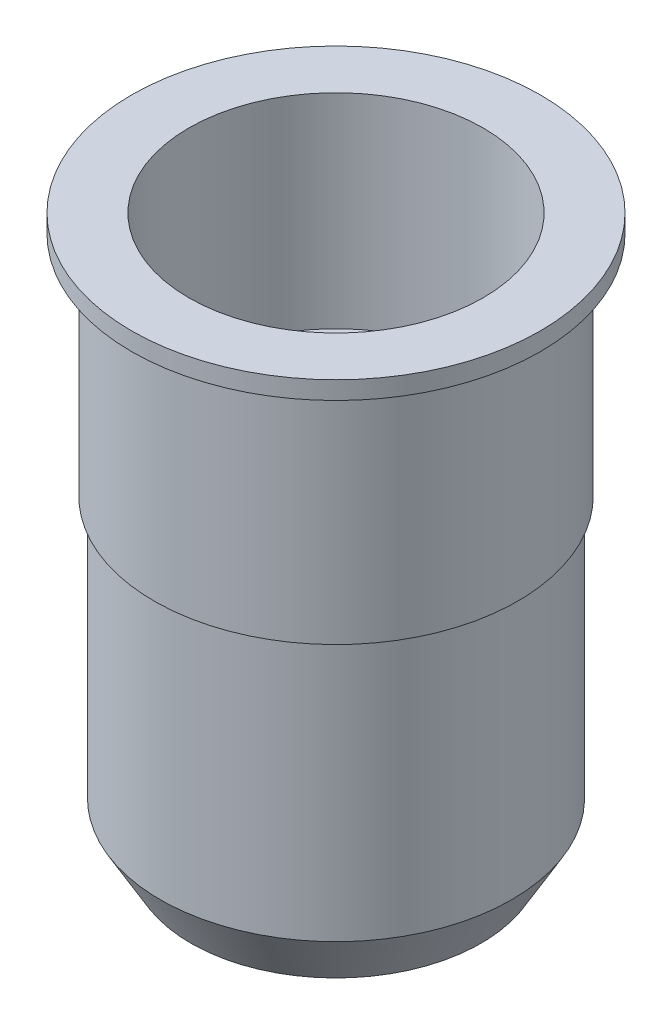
ISO-10303-21;
HEADER;
FILE_DESCRIPTION(('STEP AP214'),'2;1');
FILE_NAME('part.step','',(''),(''),'','','');
FILE_SCHEMA(('AUTOMOTIVE_DESIGN { 1 0 10303 214 1 1 1 1 }'));
ENDSEC;
DATA;
#1=APPLICATION_CONTEXT('core data for automotive mechanical design processes');
#2=APPLICATION_PROTOCOL_DEFINITION('international standard','automotive_design',2000,#1);
#3=PRODUCT_CONTEXT('',#1,'mechanical');
#4=PRODUCT('Part','Part','',(#3));
#5=PRODUCT_RELATED_PRODUCT_CATEGORY('part','',(#4));
#6=PRODUCT_DEFINITION_FORMATION('','',#4);
#7=PRODUCT_DEFINITION_CONTEXT('part definition',#1,'design');
#8=PRODUCT_DEFINITION('design','',#6,#7);
#9=PRODUCT_DEFINITION_SHAPE('','',#8);
#10=(LENGTH_UNIT() NAMED_UNIT(*) SI_UNIT(.MILLI.,.METRE.));
#11=(NAMED_UNIT(*) PLANE_ANGLE_UNIT() SI_UNIT($,.RADIAN.));
#12=(NAMED_UNIT(*) SI_UNIT($,.STERADIAN.) SOLID_ANGLE_UNIT());
#13=UNCERTAINTY_MEASURE_WITH_UNIT(LENGTH_MEASURE(1.E-05),#10,'distance_accuracy_value','');
#14=(GEOMETRIC_REPRESENTATION_CONTEXT(3) GLOBAL_UNCERTAINTY_ASSIGNED_CONTEXT((#13)) GLOBAL_UNIT_ASSIGNED_CONTEXT((#10,
#11,#12)) REPRESENTATION_CONTEXT('',''));
#15=CARTESIAN_POINT('',(0.,0.,0.));
#16=DIRECTION('',(0.,0.,1.));
#17=DIRECTION('',(1.,0.,0.));
#18=AXIS2_PLACEMENT_3D('',#15,#16,#17);
#19=CARTESIAN_POINT('',(4.3,-13.7,0.));
#20=DIRECTION('',(0.,1.,0.));
#21=DIRECTION('',(-1.,0.,0.));
#22=AXIS2_PLACEMENT_3D('',#19,#20,#21);
#23=PLANE('',#22);
#24=CARTESIAN_POINT('',(0.,-13.7,0.));
#25=DIRECTION('',(0.,1.,0.));
#26=DIRECTION('',(-1.,0.,0.));
#27=AXIS2_PLACEMENT_3D('',#24,#25,#26);
#28=CIRCLE('',#27,3.54999999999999);
#29=CARTESIAN_POINT('',(-3.54999999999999,-13.7,0.));
#30=VERTEX_POINT('',#29);
#31=EDGE_CURVE('E36',#30,#30,#28,.F.);
#32=ORIENTED_EDGE('',*,*,#31,.T.);
#33=EDGE_LOOP('',(#32));
#34=FACE_BOUND('',#33,.T.);
#35=CARTESIAN_POINT('',(0.,-13.7,0.));
#36=DIRECTION('',(0.,1.,0.));
#37=DIRECTION('',(-1.,0.,0.));
#38=AXIS2_PLACEMENT_3D('',#35,#36,#37);
#39=CIRCLE('',#38,2.5);
#40=CARTESIAN_POINT('',(-2.5,-13.7,0.));
#41=VERTEX_POINT('',#40);
#42=EDGE_CURVE('E45',#41,#41,#39,.T.);
#43=ORIENTED_EDGE('',*,*,#42,.T.);
#44=EDGE_LOOP('',(#43));
#45=FACE_BOUND('',#44,.T.);
#46=ADVANCED_FACE('F26',(#34,#45),#23,.F.);
#47=CARTESIAN_POINT('',(0.,6.30148961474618,0.));
#48=DIRECTION('',(0.,1.,0.));
#49=DIRECTION('',(-1.,0.,0.));
#50=AXIS2_PLACEMENT_3D('',#47,#48,#49);
#51=CYLINDRICAL_SURFACE('',#50,2.5);
#52=ORIENTED_EDGE('',*,*,#42,.F.);
#53=EDGE_LOOP('',(#52));
#54=FACE_BOUND('',#53,.T.);
#55=CARTESIAN_POINT('',(0.,-5.,0.));
#56=DIRECTION('',(0.,1.,0.));
#57=DIRECTION('',(-1.,0.,0.));
#58=AXIS2_PLACEMENT_3D('',#55,#56,#57);
#59=CIRCLE('',#58,2.5);
#60=CARTESIAN_POINT('',(-2.5,-5.,0.));
#61=VERTEX_POINT('',#60);
#62=EDGE_CURVE('E48',#61,#61,#59,.T.);
#63=ORIENTED_EDGE('',*,*,#62,.T.);
#64=EDGE_LOOP('',(#63));
#65=FACE_BOUND('',#64,.T.);
#66=ADVANCED_FACE('F88',(#54,#65),#51,.F.);
#67=CARTESIAN_POINT('',(2.5,-5.,0.));
#68=DIRECTION('',(0.,-1.,0.));
#69=DIRECTION('',(1.,0.,0.));
#70=AXIS2_PLACEMENT_3D('',#67,#68,#69);
#71=PLANE('',#70);
#72=ORIENTED_EDGE('',*,*,#62,.F.);
#73=EDGE_LOOP('',(#72));
#74=FACE_BOUND('',#73,.T.);
#75=CARTESIAN_POINT('',(0.,-5.,0.));
#76=DIRECTION('',(0.,1.,0.));
#77=DIRECTION('',(-1.,0.,0.));
#78=AXIS2_PLACEMENT_3D('',#75,#76,#77);
#79=CIRCLE('',#78,3.6);
#80=CARTESIAN_POINT('',(-3.6,-5.,0.));
#81=VERTEX_POINT('',#80);
#82=EDGE_CURVE('E51',#81,#81,#79,.T.);
#83=ORIENTED_EDGE('',*,*,#82,.T.);
#84=EDGE_LOOP('',(#83));
#85=FACE_BOUND('',#84,.T.);
#86=ADVANCED_FACE('F93',(#74,#85),#71,.F.);
#87=CARTESIAN_POINT('',(0.,6.30148961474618,0.));
#88=DIRECTION('',(0.,1.,0.));
#89=DIRECTION('',(-1.,0.,0.));
#90=AXIS2_PLACEMENT_3D('',#87,#88,#89);
#91=CYLINDRICAL_SURFACE('',#90,3.6);
#92=ORIENTED_EDGE('',*,*,#82,.F.);
#93=EDGE_LOOP('',(#92));
#94=FACE_BOUND('',#93,.T.);
#95=CARTESIAN_POINT('',(0.,0.,0.));
#96=DIRECTION('',(0.,1.,0.));
#97=DIRECTION('',(-1.,0.,0.));
#98=AXIS2_PLACEMENT_3D('',#95,#96,#97);
#99=CIRCLE('',#98,3.6);
#100=CARTESIAN_POINT('',(-3.6,0.,0.));
#101=VERTEX_POINT('',#100);
#102=EDGE_CURVE('E54',#101,#101,#99,.T.);
#103=ORIENTED_EDGE('',*,*,#102,.T.);
#104=EDGE_LOOP('',(#103));
#105=FACE_BOUND('',#104,.T.);
#106=ADVANCED_FACE('F103',(#94,#105),#91,.F.);
#107=CARTESIAN_POINT('',(3.6,0.,0.));
#108=DIRECTION('',(0.,-1.,0.));
#109=DIRECTION('',(1.,0.,0.));
#110=AXIS2_PLACEMENT_3D('',#107,#108,#109);
#111=PLANE('',#110);
#112=ORIENTED_EDGE('',*,*,#102,.F.);
#113=EDGE_LOOP('',(#112));
#114=FACE_BOUND('',#113,.T.);
#115=CARTESIAN_POINT('',(0.,0.,0.));
#116=DIRECTION('',(0.,1.,0.));
#117=DIRECTION('',(-1.,0.,0.));
#118=AXIS2_PLACEMENT_3D('',#115,#116,#117);
#119=CIRCLE('',#118,5.);
#120=CARTESIAN_POINT('',(-5.,0.,0.));
#121=VERTEX_POINT('',#120);
#122=EDGE_CURVE('E57',#121,#121,#119,.T.);
#123=ORIENTED_EDGE('',*,*,#122,.T.);
#124=EDGE_LOOP('',(#123));
#125=FACE_BOUND('',#124,.T.);
#126=ADVANCED_FACE('F109',(#114,#125),#111,.F.);
#127=CARTESIAN_POINT('',(0.,6.30148961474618,0.));
#128=DIRECTION('',(0.,1.,0.));
#129=DIRECTION('',(-1.,0.,0.));
#130=AXIS2_PLACEMENT_3D('',#127,#128,#129);
#131=CYLINDRICAL_SURFACE('',#130,5.);
#132=CARTESIAN_POINT('',(0.,-0.440192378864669,0.));
#133=DIRECTION('',(0.,1.,0.));
#134=DIRECTION('',(-1.,0.,0.));
#135=AXIS2_PLACEMENT_3D('',#132,#133,#134);
#136=CIRCLE('',#135,5.);
#137=CARTESIAN_POINT('',(-5.,-0.44019237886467,0.));
#138=VERTEX_POINT('',#137);
#139=EDGE_CURVE('E32',#138,#138,#136,.T.);
#140=ORIENTED_EDGE('',*,*,#139,.T.);
#141=EDGE_LOOP('',(#140));
#142=FACE_BOUND('',#141,.T.);
#143=ORIENTED_EDGE('',*,*,#122,.F.);
#144=EDGE_LOOP('',(#143));
#145=FACE_BOUND('',#144,.T.);
#146=ADVANCED_FACE('F115',(#142,#145),#131,.T.);
#147=CARTESIAN_POINT('',(4.45,-0.7,0.));
#148=DIRECTION('',(0.,1.,0.));
#149=DIRECTION('',(-1.,0.,0.));
#150=AXIS2_PLACEMENT_3D('',#147,#148,#149);
#151=PLANE('',#150);
#152=CARTESIAN_POINT('',(0.,-0.700000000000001,0.));
#153=DIRECTION('',(0.,1.,0.));
#154=DIRECTION('',(-1.,0.,0.));
#155=AXIS2_PLACEMENT_3D('',#152,#153,#154);
#156=CIRCLE('',#155,4.55);
#157=CARTESIAN_POINT('',(-4.55,-0.700000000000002,0.));
#158=VERTEX_POINT('',#157);
#159=EDGE_CURVE('E10',#158,#158,#156,.F.);
#160=ORIENTED_EDGE('',*,*,#159,.T.);
#161=EDGE_LOOP('',(#160));
#162=FACE_BOUND('',#161,.T.);
#163=CARTESIAN_POINT('',(0.,-0.700000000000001,0.));
#164=DIRECTION('',(0.,1.,0.));
#165=DIRECTION('',(-1.,0.,0.));
#166=AXIS2_PLACEMENT_3D('',#163,#164,#165);
#167=CIRCLE('',#166,4.45);
#168=CARTESIAN_POINT('',(-4.45,-0.700000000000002,0.));
#169=VERTEX_POINT('',#168);
#170=EDGE_CURVE('E60',#169,#169,#167,.T.);
#171=ORIENTED_EDGE('',*,*,#170,.T.);
#172=EDGE_LOOP('',(#171));
#173=FACE_BOUND('',#172,.T.);
#174=ADVANCED_FACE('F120',(#162,#173),#151,.F.);
#175=CARTESIAN_POINT('',(0.,6.30148961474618,0.));
#176=DIRECTION('',(0.,1.,0.));
#177=DIRECTION('',(-1.,0.,0.));
#178=AXIS2_PLACEMENT_3D('',#175,#176,#177);
#179=CYLINDRICAL_SURFACE('',#178,4.45);
#180=ORIENTED_EDGE('',*,*,#170,.F.);
#181=EDGE_LOOP('',(#180));
#182=FACE_BOUND('',#181,.T.);
#183=CARTESIAN_POINT('',(0.,-6.,0.));
#184=DIRECTION('',(0.,1.,0.));
#185=DIRECTION('',(-1.,0.,0.));
#186=AXIS2_PLACEMENT_3D('',#183,#184,#185);
#187=CIRCLE('',#186,4.45);
#188=CARTESIAN_POINT('',(-4.45,-6.,0.));
#189=VERTEX_POINT('',#188);
#190=EDGE_CURVE('E63',#189,#189,#187,.T.);
#191=ORIENTED_EDGE('',*,*,#190,.T.);
#192=EDGE_LOOP('',(#191));
#193=FACE_BOUND('',#192,.T.);
#194=ADVANCED_FACE('F84',(#182,#193),#179,.T.);
#195=CARTESIAN_POINT('',(4.3,-6.,0.));
#196=DIRECTION('',(0.,1.,0.));
#197=DIRECTION('',(-1.,0.,0.));
#198=AXIS2_PLACEMENT_3D('',#195,#196,#197);
#199=PLANE('',#198);
#200=ORIENTED_EDGE('',*,*,#190,.F.);
#201=EDGE_LOOP('',(#200));
#202=FACE_BOUND('',#201,.T.);
#203=CARTESIAN_POINT('',(0.,-6.,0.));
#204=DIRECTION('',(0.,1.,0.));
#205=DIRECTION('',(-1.,0.,0.));
#206=AXIS2_PLACEMENT_3D('',#203,#204,#205);
#207=CIRCLE('',#206,4.3);
#208=CARTESIAN_POINT('',(-4.3,-6.,0.));
#209=VERTEX_POINT('',#208);
#210=EDGE_CURVE('E66',#209,#209,#207,.T.);
#211=ORIENTED_EDGE('',*,*,#210,.T.);
#212=EDGE_LOOP('',(#211));
#213=FACE_BOUND('',#212,.T.);
#214=ADVANCED_FACE('F70',(#202,#213),#199,.F.);
#215=CARTESIAN_POINT('',(0.,6.30148961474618,0.));
#216=DIRECTION('',(0.,1.,0.));
#217=DIRECTION('',(-1.,0.,0.));
#218=AXIS2_PLACEMENT_3D('',#215,#216,#217);
#219=CYLINDRICAL_SURFACE('',#218,4.3);
#220=CARTESIAN_POINT('',(0.,-12.4009618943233,0.));
#221=DIRECTION('',(0.,1.,0.));
#222=DIRECTION('',(-1.,0.,0.));
#223=AXIS2_PLACEMENT_3D('',#220,#221,#222);
#224=CIRCLE('',#223,4.3);
#225=CARTESIAN_POINT('',(-4.3,-12.4009618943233,0.));
#226=VERTEX_POINT('',#225);
#227=EDGE_CURVE('E40',#226,#226,#224,.T.);
#228=ORIENTED_EDGE('',*,*,#227,.T.);
#229=EDGE_LOOP('',(#228));
#230=FACE_BOUND('',#229,.T.);
#231=ORIENTED_EDGE('',*,*,#210,.F.);
#232=EDGE_LOOP('',(#231));
#233=FACE_BOUND('',#232,.T.);
#234=ADVANCED_FACE('F72',(#230,#233),#219,.T.);
#235=CARTESIAN_POINT('',(0.,-12.4009618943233,0.));
#236=DIRECTION('',(0.,1.,0.));
#237=DIRECTION('',(-1.,0.,0.));
#238=AXIS2_PLACEMENT_3D('',#235,#236,#237);
#239=CONICAL_SURFACE('',#238,4.3,0.5235987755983);
#240=ORIENTED_EDGE('',*,*,#31,.F.);
#241=EDGE_LOOP('',(#240));
#242=FACE_BOUND('',#241,.T.);
#243=ORIENTED_EDGE('',*,*,#227,.F.);
#244=EDGE_LOOP('',(#243));
#245=FACE_BOUND('',#244,.T.);
#246=ADVANCED_FACE('F74',(#242,#245),#239,.T.);
#247=CARTESIAN_POINT('',(0.,-0.440192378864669,0.));
#248=DIRECTION('',(0.,1.,0.));
#249=DIRECTION('',(-1.,0.,0.));
#250=AXIS2_PLACEMENT_3D('',#247,#248,#249);
#251=CONICAL_SURFACE('',#250,5.,1.0471975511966);
#252=ORIENTED_EDGE('',*,*,#159,.F.);
#253=EDGE_LOOP('',(#252));
#254=FACE_BOUND('',#253,.T.);
#255=ORIENTED_EDGE('',*,*,#139,.F.);
#256=EDGE_LOOP('',(#255));
#257=FACE_BOUND('',#256,.T.);
#258=ADVANCED_FACE('F81',(#254,#257),#251,.T.);
#259=CLOSED_SHELL('',(#46,#66,#86,#106,#126,#146,#174,#194,#214,#234,#246,#258));
#260=MANIFOLD_SOLID_BREP('B2',#259);
#261=ADVANCED_BREP_SHAPE_REPRESENTATION('',(#18,#260),#14);
#262=SHAPE_DEFINITION_REPRESENTATION(#9,#261);
ENDSEC;
END-ISO-10303-21;
